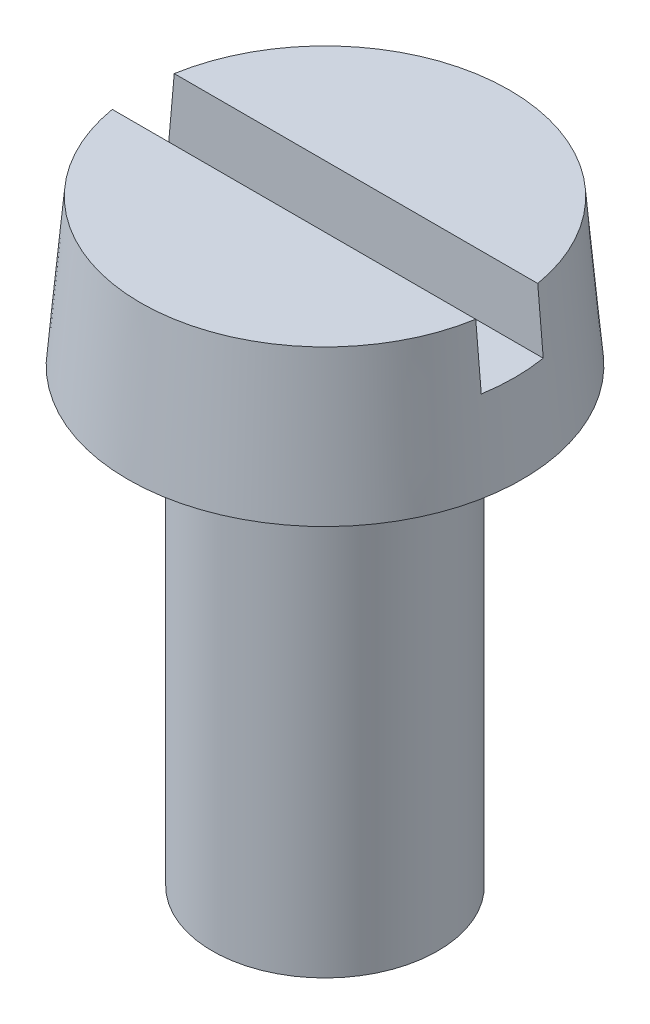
ISO-10303-21;
HEADER;
FILE_DESCRIPTION(('STEP AP214'),'2;1');
FILE_NAME('part.step','',(''),(''),'','','');
FILE_SCHEMA(('AUTOMOTIVE_DESIGN { 1 0 10303 214 1 1 1 1 }'));
ENDSEC;
DATA;
#1=APPLICATION_CONTEXT('core data for automotive mechanical design processes');
#2=APPLICATION_PROTOCOL_DEFINITION('international standard','automotive_design',2000,#1);
#3=PRODUCT_CONTEXT('',#1,'mechanical');
#4=PRODUCT('Part','Part','',(#3));
#5=PRODUCT_RELATED_PRODUCT_CATEGORY('part','',(#4));
#6=PRODUCT_DEFINITION_FORMATION('','',#4);
#7=PRODUCT_DEFINITION_CONTEXT('part definition',#1,'design');
#8=PRODUCT_DEFINITION('design','',#6,#7);
#9=PRODUCT_DEFINITION_SHAPE('','',#8);
#10=(LENGTH_UNIT() NAMED_UNIT(*) SI_UNIT(.MILLI.,.METRE.));
#11=(NAMED_UNIT(*) PLANE_ANGLE_UNIT() SI_UNIT($,.RADIAN.));
#12=(NAMED_UNIT(*) SI_UNIT($,.STERADIAN.) SOLID_ANGLE_UNIT());
#13=UNCERTAINTY_MEASURE_WITH_UNIT(LENGTH_MEASURE(1.E-05),#10,'distance_accuracy_value','');
#14=(GEOMETRIC_REPRESENTATION_CONTEXT(3) GLOBAL_UNCERTAINTY_ASSIGNED_CONTEXT((#13)) GLOBAL_UNIT_ASSIGNED_CONTEXT((#10,
#11,#12)) REPRESENTATION_CONTEXT('',''));
#15=CARTESIAN_POINT('',(0.,0.,0.));
#16=DIRECTION('',(0.,0.,1.));
#17=DIRECTION('',(1.,0.,0.));
#18=AXIS2_PLACEMENT_3D('',#15,#16,#17);
#19=CARTESIAN_POINT('',(4.19999999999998,1.49999999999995,0.550000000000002));
#20=DIRECTION('',(0.,-1.,0.));
#21=DIRECTION('',(0.,0.,-1.));
#22=AXIS2_PLACEMENT_3D('',#19,#20,#21);
#23=PLANE('',#22);
#24=CARTESIAN_POINT('',(0.,1.50000000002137,0.));
#25=DIRECTION('',(0.,-1.,0.));
#26=DIRECTION('',(0.,0.,-1.));
#27=AXIS2_PLACEMENT_3D('',#24,#25,#26);
#28=CIRCLE('',#27,3.36876700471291);
#29=CARTESIAN_POINT('',(-3.32356602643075,1.50000000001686,0.550000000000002));
#30=VERTEX_POINT('',#29);
#31=CARTESIAN_POINT('',(-3.32356602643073,1.5000000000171,-0.550000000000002));
#32=VERTEX_POINT('',#31);
#33=EDGE_CURVE('E70',#30,#32,#28,.T.);
#34=ORIENTED_EDGE('',*,*,#33,.F.);
#35=DIRECTION('',(1.,0.,0.));
#36=VECTOR('',#35,1.);
#37=CARTESIAN_POINT('',(4.20000000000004,1.50000000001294,0.550000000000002));
#38=LINE('',#37,#36);
#39=CARTESIAN_POINT('',(3.32356602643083,1.50000000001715,0.550000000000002));
#40=VERTEX_POINT('',#39);
#41=EDGE_CURVE('E68',#30,#40,#38,.T.);
#42=ORIENTED_EDGE('',*,*,#41,.T.);
#43=CARTESIAN_POINT('',(0.,1.50000000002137,0.));
#44=DIRECTION('',(0.,-1.,0.));
#45=DIRECTION('',(0.,0.,-1.));
#46=AXIS2_PLACEMENT_3D('',#43,#44,#45);
#47=CIRCLE('',#46,3.36876700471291);
#48=CARTESIAN_POINT('',(3.32356602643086,1.50000000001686,-0.550000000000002));
#49=VERTEX_POINT('',#48);
#50=EDGE_CURVE('E19',#49,#40,#47,.T.);
#51=ORIENTED_EDGE('',*,*,#50,.F.);
#52=DIRECTION('',(1.,0.,0.));
#53=VECTOR('',#52,1.);
#54=CARTESIAN_POINT('',(4.19999999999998,1.50000000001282,-0.550000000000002));
#55=LINE('',#54,#53);
#56=EDGE_CURVE('E63',#49,#32,#55,.F.);
#57=ORIENTED_EDGE('',*,*,#56,.T.);
#58=EDGE_LOOP('',(#34,#42,#51,#57));
#59=FACE_BOUND('',#58,.T.);
#60=ADVANCED_FACE('F16',(#59),#23,.F.);
#61=CARTESIAN_POINT('',(4.20000000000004,2.59999999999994,0.550000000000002));
#62=DIRECTION('',(0.,0.,1.));
#63=DIRECTION('',(0.,-1.,0.));
#64=AXIS2_PLACEMENT_3D('',#61,#62,#63);
#65=PLANE('',#64);
#66=DIRECTION('',(1.,0.,0.));
#67=VECTOR('',#66,1.);
#68=CARTESIAN_POINT('',(-1.11022302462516E-13,2.60000000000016,0.550000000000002));
#69=LINE('',#68,#67);
#70=CARTESIAN_POINT('',(-3.22598034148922,2.59999999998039,0.550000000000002));
#71=VERTEX_POINT('',#70);
#72=CARTESIAN_POINT('',(3.22598034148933,2.59999999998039,0.550000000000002));
#73=VERTEX_POINT('',#72);
#74=EDGE_CURVE('E72',#71,#73,#69,.T.);
#75=ORIENTED_EDGE('',*,*,#74,.T.);
#76=CARTESIAN_POINT('',(3.32356602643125,1.50000000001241,0.550000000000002));
#77=CARTESIAN_POINT('',(3.30730834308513,1.68333391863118,0.550000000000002));
#78=CARTESIAN_POINT('',(3.29104736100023,1.86666754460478,0.550000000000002));
#79=CARTESIAN_POINT('',(3.25851879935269,2.23333421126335,0.550000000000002));
#80=CARTESIAN_POINT('',(3.24225121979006,2.41666725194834,0.550000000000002));
#81=CARTESIAN_POINT('',(3.22598034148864,2.59999999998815,0.550000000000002));
#82=B_SPLINE_CURVE_WITH_KNOTS('',3,(#76,#77,#78,#79,#80,#81),.UNSPECIFIED.,.F.,.F.,(4,2,4),(0.,
0.552160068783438,1.10432013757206),.UNSPECIFIED.);
#83=EDGE_CURVE('E79',#40,#73,#82,.T.);
#84=ORIENTED_EDGE('',*,*,#83,.F.);
#85=ORIENTED_EDGE('',*,*,#41,.F.);
#86=CARTESIAN_POINT('',(-3.22598034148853,2.59999999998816,0.550000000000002));
#87=CARTESIAN_POINT('',(-3.24225121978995,2.41666725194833,0.550000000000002));
#88=CARTESIAN_POINT('',(-3.25851879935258,2.23333421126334,0.550000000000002));
#89=CARTESIAN_POINT('',(-3.29104736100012,1.86666754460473,0.550000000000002));
#90=CARTESIAN_POINT('',(-3.30730834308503,1.68333391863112,0.550000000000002));
#91=CARTESIAN_POINT('',(-3.32356602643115,1.50000000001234,0.550000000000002));
#92=B_SPLINE_CURVE_WITH_KNOTS('',3,(#86,#87,#88,#89,#90,#91),.UNSPECIFIED.,.F.,.F.,(4,2,4),(0.,
0.552160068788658,1.10432013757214),.UNSPECIFIED.);
#93=EDGE_CURVE('E110',#71,#30,#92,.T.);
#94=ORIENTED_EDGE('',*,*,#93,.F.);
#95=EDGE_LOOP('',(#75,#84,#85,#94));
#96=FACE_BOUND('',#95,.T.);
#97=ADVANCED_FACE('F119',(#96),#65,.F.);
#98=CARTESIAN_POINT('',(4.19999999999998,1.49999999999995,-0.550000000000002));
#99=DIRECTION('',(0.,0.,-1.));
#100=DIRECTION('',(0.,1.,0.));
#101=AXIS2_PLACEMENT_3D('',#98,#99,#100);
#102=PLANE('',#101);
#103=CARTESIAN_POINT('',(3.22598034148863,2.59999999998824,-0.550000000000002));
#104=CARTESIAN_POINT('',(3.24225121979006,2.4166672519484,-0.550000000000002));
#105=CARTESIAN_POINT('',(3.25851879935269,2.23333421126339,-0.550000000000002));
#106=CARTESIAN_POINT('',(3.29104736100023,1.86666754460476,-0.550000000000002));
#107=CARTESIAN_POINT('',(3.30730834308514,1.68333391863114,-0.550000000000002));
#108=CARTESIAN_POINT('',(3.32356602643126,1.50000000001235,-0.550000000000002));
#109=B_SPLINE_CURVE_WITH_KNOTS('',3,(#103,#104,#105,#106,#107,#108),.UNSPECIFIED.,.F.,.F.,(4,2,
4),(0.,0.552160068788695,1.10432013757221),.UNSPECIFIED.);
#110=CARTESIAN_POINT('',(3.22598034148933,2.59999999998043,-0.550000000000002));
#111=VERTEX_POINT('',#110);
#112=EDGE_CURVE('E52',#111,#49,#109,.T.);
#113=ORIENTED_EDGE('',*,*,#112,.F.);
#114=DIRECTION('',(1.,0.,0.));
#115=VECTOR('',#114,1.);
#116=CARTESIAN_POINT('',(-1.11022302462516E-13,2.60000000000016,-0.550000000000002));
#117=LINE('',#116,#115);
#118=CARTESIAN_POINT('',(-3.22598034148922,2.59999999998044,-0.550000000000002));
#119=VERTEX_POINT('',#118);
#120=EDGE_CURVE('E75',#111,#119,#117,.F.);
#121=ORIENTED_EDGE('',*,*,#120,.T.);
#122=CARTESIAN_POINT('',(-3.32356602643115,1.50000000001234,-0.550000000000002));
#123=CARTESIAN_POINT('',(-3.30730834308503,1.68333391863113,-0.550000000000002));
#124=CARTESIAN_POINT('',(-3.29104736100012,1.86666754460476,-0.550000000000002));
#125=CARTESIAN_POINT('',(-3.25851879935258,2.23333421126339,-0.550000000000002));
#126=CARTESIAN_POINT('',(-3.24225121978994,2.4166672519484,-0.550000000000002));
#127=CARTESIAN_POINT('',(-3.22598034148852,2.59999999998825,-0.550000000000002));
#128=B_SPLINE_CURVE_WITH_KNOTS('',3,(#122,#123,#124,#125,#126,#127),.UNSPECIFIED.,.F.,.F.,(4,2,
4),(0.,0.552160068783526,1.10432013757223),.UNSPECIFIED.);
#129=EDGE_CURVE('E34',#32,#119,#128,.T.);
#130=ORIENTED_EDGE('',*,*,#129,.F.);
#131=ORIENTED_EDGE('',*,*,#56,.F.);
#132=EDGE_LOOP('',(#113,#121,#130,#131));
#133=FACE_BOUND('',#132,.T.);
#134=ADVANCED_FACE('F71',(#133),#102,.F.);
#135=CARTESIAN_POINT('',(-1.11022302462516E-13,2.60000000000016,0.));
#136=DIRECTION('',(0.,-1.,0.));
#137=DIRECTION('',(0.,0.,-1.));
#138=AXIS2_PLACEMENT_3D('',#135,#136,#137);
#139=PLANE('',#138);
#140=CARTESIAN_POINT('',(0.,2.59999999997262,0.));
#141=DIRECTION('',(0.,-1.,0.));
#142=DIRECTION('',(0.,0.,-1.));
#143=AXIS2_PLACEMENT_3D('',#140,#141,#142);
#144=CIRCLE('',#143,3.27252947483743);
#145=EDGE_CURVE('E87',#73,#71,#144,.T.);
#146=ORIENTED_EDGE('',*,*,#145,.F.);
#147=ORIENTED_EDGE('',*,*,#74,.F.);
#148=EDGE_LOOP('',(#146,#147));
#149=FACE_BOUND('',#148,.T.);
#150=ADVANCED_FACE('F129',(#149),#139,.F.);
#151=CARTESIAN_POINT('',(-1.11022302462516E-13,2.60000000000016,0.));
#152=DIRECTION('',(0.,-1.,0.));
#153=DIRECTION('',(0.,0.,-1.));
#154=AXIS2_PLACEMENT_3D('',#151,#152,#153);
#155=PLANE('',#154);
#156=ORIENTED_EDGE('',*,*,#120,.F.);
#157=CARTESIAN_POINT('',(0.,2.59999999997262,0.));
#158=DIRECTION('',(0.,-1.,0.));
#159=DIRECTION('',(0.,0.,-1.));
#160=AXIS2_PLACEMENT_3D('',#157,#158,#159);
#161=CIRCLE('',#160,3.27252947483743);
#162=EDGE_CURVE('E59',#119,#111,#161,.T.);
#163=ORIENTED_EDGE('',*,*,#162,.F.);
#164=EDGE_LOOP('',(#156,#163));
#165=FACE_BOUND('',#164,.T.);
#166=ADVANCED_FACE('F106',(#165),#155,.F.);
#167=CARTESIAN_POINT('',(0.,1.13686837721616E-10,0.));
#168=DIRECTION('',(0.,-1.,0.));
#169=DIRECTION('',(0.,0.,-1.));
#170=AXIS2_PLACEMENT_3D('',#167,#168,#169);
#171=CONICAL_SURFACE('',#170,3.4999999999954,0.0872664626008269);
#172=ORIENTED_EDGE('',*,*,#83,.T.);
#173=ORIENTED_EDGE('',*,*,#145,.T.);
#174=ORIENTED_EDGE('',*,*,#93,.T.);
#175=ORIENTED_EDGE('',*,*,#33,.T.);
#176=ORIENTED_EDGE('',*,*,#129,.T.);
#177=ORIENTED_EDGE('',*,*,#162,.T.);
#178=ORIENTED_EDGE('',*,*,#112,.T.);
#179=ORIENTED_EDGE('',*,*,#50,.T.);
#180=EDGE_LOOP('',(#172,#173,#174,#175,#176,#177,#178,#179));
#181=FACE_BOUND('',#180,.T.);
#182=CARTESIAN_POINT('',(0.,0.,0.));
#183=DIRECTION('',(0.,-1.,0.));
#184=DIRECTION('',(0.,0.,-1.));
#185=AXIS2_PLACEMENT_3D('',#182,#183,#184);
#186=CIRCLE('',#185,3.50000000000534);
#187=CARTESIAN_POINT('',(0.,0.,-3.50000000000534));
#188=VERTEX_POINT('',#187);
#189=EDGE_CURVE('E83',#188,#188,#186,.T.);
#190=ORIENTED_EDGE('',*,*,#189,.F.);
#191=EDGE_LOOP('',(#190));
#192=FACE_BOUND('',#191,.T.);
#193=ADVANCED_FACE('F55',(#181,#192),#171,.T.);
#194=CARTESIAN_POINT('',(0.,0.,0.));
#195=DIRECTION('',(0.,-1.,0.));
#196=DIRECTION('',(0.,0.,-1.));
#197=AXIS2_PLACEMENT_3D('',#194,#195,#196);
#198=PLANE('',#197);
#199=ORIENTED_EDGE('',*,*,#189,.T.);
#200=EDGE_LOOP('',(#199));
#201=FACE_BOUND('',#200,.T.);
#202=CARTESIAN_POINT('',(-1.11022302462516E-13,0.,0.));
#203=DIRECTION('',(0.,-1.,0.));
#204=DIRECTION('',(0.,0.,-1.));
#205=AXIS2_PLACEMENT_3D('',#202,#203,#204);
#206=CIRCLE('',#205,2.);
#207=CARTESIAN_POINT('',(-1.11022302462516E-13,0.,-2.));
#208=VERTEX_POINT('',#207);
#209=EDGE_CURVE('E25',#208,#208,#206,.T.);
#210=ORIENTED_EDGE('',*,*,#209,.F.);
#211=EDGE_LOOP('',(#210));
#212=FACE_BOUND('',#211,.T.);
#213=ADVANCED_FACE('F105',(#201,#212),#198,.T.);
#214=CARTESIAN_POINT('',(0.,-7.99999999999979,0.));
#215=DIRECTION('',(0.,-1.,0.));
#216=DIRECTION('',(0.,0.,-1.));
#217=AXIS2_PLACEMENT_3D('',#214,#215,#216);
#218=PLANE('',#217);
#219=CARTESIAN_POINT('',(-1.11022302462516E-13,-7.99999999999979,0.));
#220=DIRECTION('',(0.,-1.,0.));
#221=DIRECTION('',(0.,0.,-1.));
#222=AXIS2_PLACEMENT_3D('',#219,#220,#221);
#223=CIRCLE('',#222,2.);
#224=CARTESIAN_POINT('',(-1.11022302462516E-13,-7.99999999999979,-2.));
#225=VERTEX_POINT('',#224);
#226=EDGE_CURVE('E11',#225,#225,#223,.F.);
#227=ORIENTED_EDGE('',*,*,#226,.F.);
#228=EDGE_LOOP('',(#227));
#229=FACE_BOUND('',#228,.T.);
#230=ADVANCED_FACE('F132',(#229),#218,.T.);
#231=CARTESIAN_POINT('',(-1.11022302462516E-13,3.13000000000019,0.));
#232=DIRECTION('',(0.,-1.,0.));
#233=DIRECTION('',(0.,0.,-1.));
#234=AXIS2_PLACEMENT_3D('',#231,#232,#233);
#235=CYLINDRICAL_SURFACE('',#234,2.);
#236=ORIENTED_EDGE('',*,*,#226,.T.);
#237=EDGE_LOOP('',(#236));
#238=FACE_BOUND('',#237,.T.);
#239=ORIENTED_EDGE('',*,*,#209,.T.);
#240=EDGE_LOOP('',(#239));
#241=FACE_BOUND('',#240,.T.);
#242=ADVANCED_FACE('F130',(#238,#241),#235,.T.);
#243=CLOSED_SHELL('',(#60,#97,#134,#150,#166,#193,#213,#230,#242));
#244=MANIFOLD_SOLID_BREP('B1',#243);
#245=ADVANCED_BREP_SHAPE_REPRESENTATION('',(#18,#244),#14);
#246=SHAPE_DEFINITION_REPRESENTATION(#9,#245);
ENDSEC;
END-ISO-10303-21;
